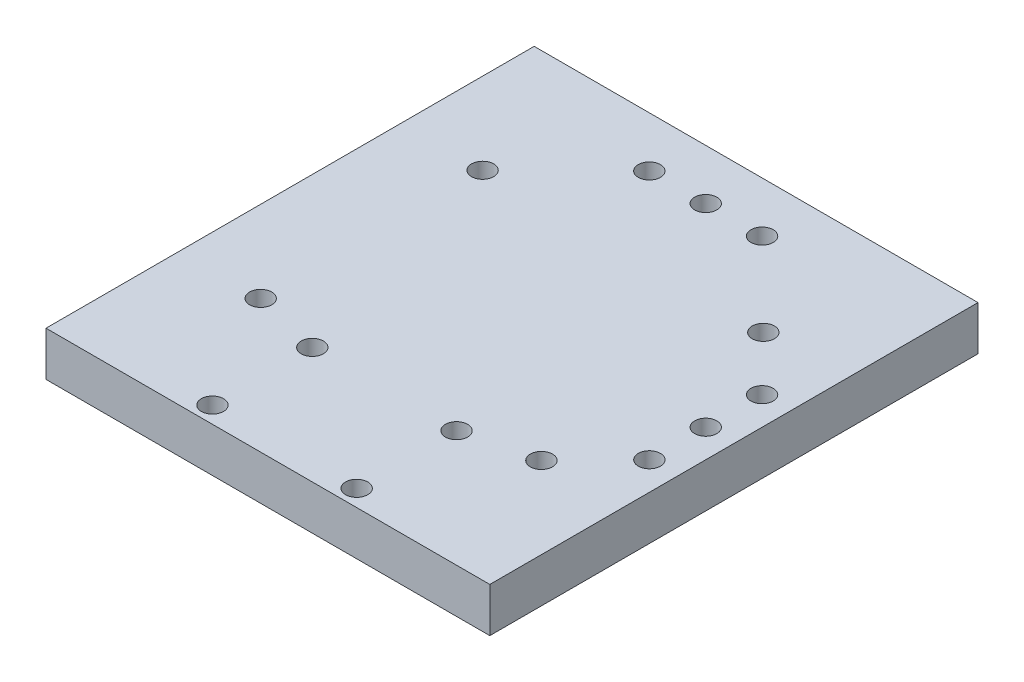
from build123d import *

# Parameters (mm, degrees)
CROQUIS1_W              = 20
CROQUIS1_H              = 22
CROQUIS1_R              = 0.5
SALIENTE_EXTRUIR1_DEPTH = 2


with BuildPart() as part:
    # Croquis1 → Saliente-Extruir1 (new body)
    with BuildSketch(Plane(origin=(0, 0, 0), x_dir=(1, 0, 0), z_dir=(0, 1, 0))):
        Rectangle(CROQUIS1_W, CROQUIS1_H)
        with Locations(Location((0, 8.73, 0), (0, 0, 270))):
            Circle(CROQUIS1_R, mode=Mode.SUBTRACT)
        with Locations(Location((8.73, 0, 0), (0, 0, 270))):
            Circle(CROQUIS1_R, mode=Mode.SUBTRACT)
        with Locations(Location((-6.325, 5, 0), (0, 0, 270))):
            Circle(CROQUIS1_R, mode=Mode.SUBTRACT)
        with Locations(Location((6.325, 5, 0), (0, 0, 270))):
            Circle(CROQUIS1_R, mode=Mode.SUBTRACT)
        with Locations(Location((6.325, -5, 0), (0, 0, 270))):
            Circle(CROQUIS1_R, mode=Mode.SUBTRACT)
        with Locations(Location((-6.325, -5, 0), (0, 0, 270))):
            Circle(CROQUIS1_R, mode=Mode.SUBTRACT)
        with Locations(Location((2.54, 8.73, 0), (0, 0, 270))):
            Circle(CROQUIS1_R, mode=Mode.SUBTRACT)
        with Locations(Location((-2.54, 8.73, 0), (0, 0, 270))):
            Circle(CROQUIS1_R, mode=Mode.SUBTRACT)
        with Locations(Location((8.73, 2.54, 0), (0, 0, 270))):
            Circle(CROQUIS1_R, mode=Mode.SUBTRACT)
        with Locations(Location((8.73, -2.54, 0), (0, 0, 270))):
            Circle(CROQUIS1_R, mode=Mode.SUBTRACT)
        with Locations(Location((-3.25, -5.75, 0), (0, 0, 270))):
            Circle(CROQUIS1_R, mode=Mode.SUBTRACT)
        with Locations(Location((3.25, -5.75, 0), (0, 0, 270))):
            Circle(CROQUIS1_R, mode=Mode.SUBTRACT)
        with Locations(Location((3.25, -10.25, 0), (0, 0, 270))):
            Circle(CROQUIS1_R, mode=Mode.SUBTRACT)
        with Locations(Location((-3.25, -10.25, 0), (0, 0, 270))):
            Circle(CROQUIS1_R, mode=Mode.SUBTRACT)
    extrude(amount=SALIENTE_EXTRUIR1_DEPTH)


solid = part.part
